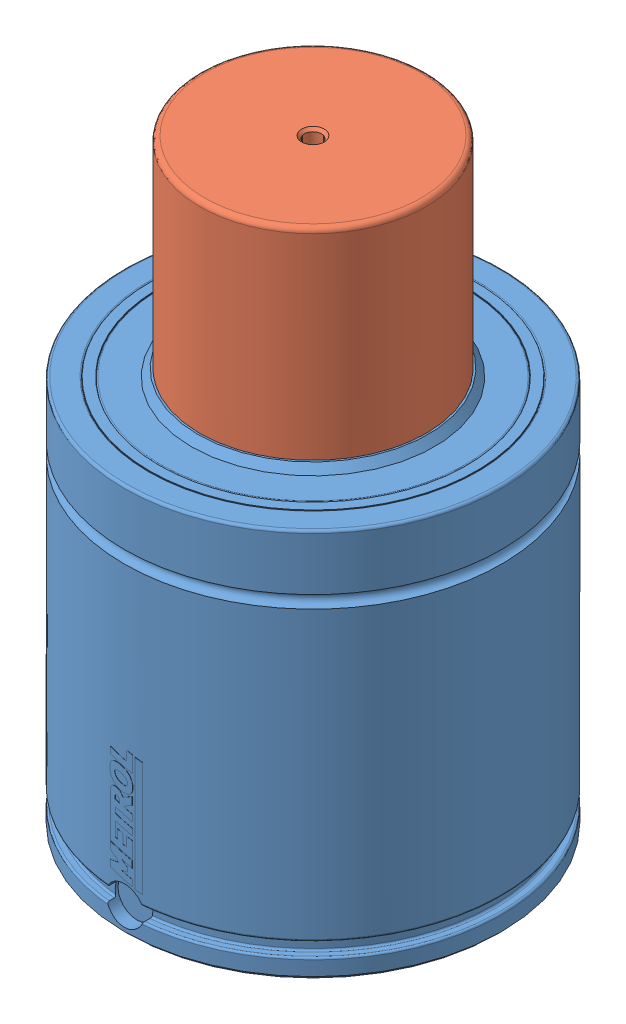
SolidWorks assembly EX9500-080.SLDASM, configuration Default (file format 7000). Lengths in mm.
Overall size (150 238 150.03).
2 component instances, 2 part files, 5 mates.
Components (placement in the parent):
- EX-9500 BODY-1: EX-9500 BODY.SLDPRT [EX-9500-080] x (0 0 1) z (0 -1 0) size (150.03 150 158)
- EX-9500 PISTON-1: EX-9500 PISTON.SLDPRT [EX-9500-080] at (0 125 0) x (0.27366 0 0.961827) z (0 -1 0) size (110 110 113)
Mates (geometry in assembly coordinates):
- Concentric1: concentric aligned: cylinder of EX-9500 BODY-1 through (0 0 0) axis (0 -1 0) radius 75; cylinder of EX-9500 PISTON-1 through (0 125 0) axis (0 -1 0) radius 45
- LimitDistance1: limit distance anti-aligned: plane of EX-9500 PISTON-1 through (-43.2822 135 12.3147) normal (0 1 0); plane of EX-9500 BODY-1 through (-45 135 0) normal (0 -1 0)
- Coincident1: coincident anti-aligned: plane of EX-9500 BODY-1 through (0 0 0) normal (0 -1 0); plane of assembly through (0 0 0) normal (0 1 0)
- Coincident2: coincident anti-aligned: plane of EX-9500 BODY-1; plane of assembly through (0 0 0) normal (1 0 0)
- Coincident4: coincident aligned: plane of EX-9500 BODY-1; plane of assembly through (0 0 0) normal (0 0 1)
